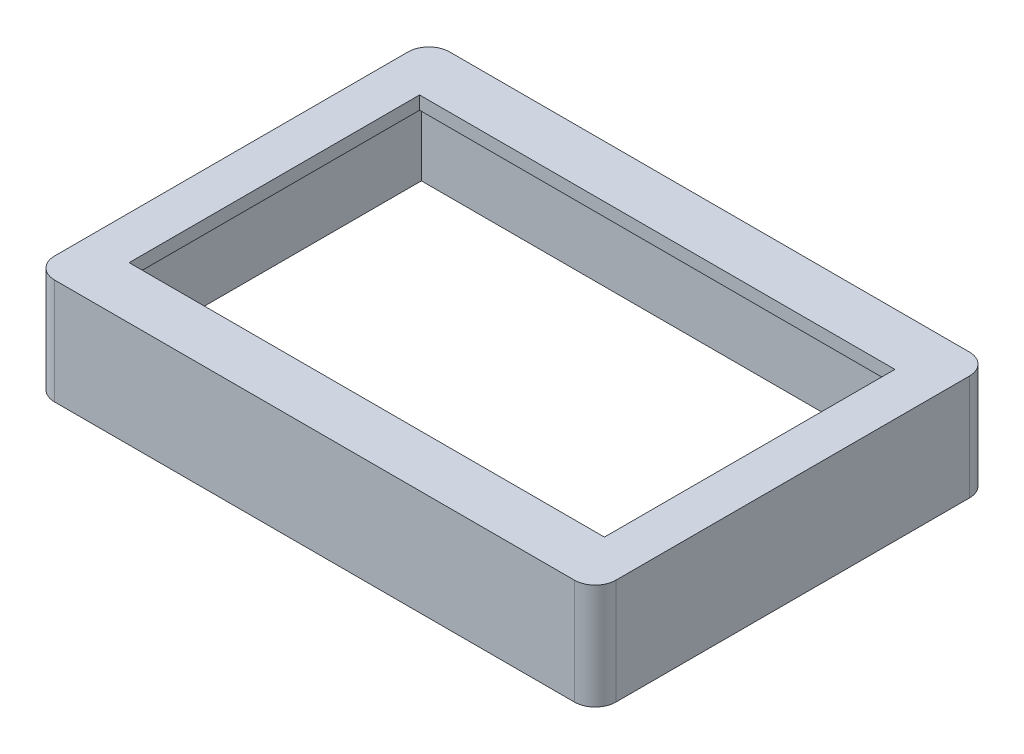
from build123d import *

# Parameters (mm, degrees)
SKETCH1_W           = 135
SKETCH1_H           = 95
BOSS_EXTRUDE1_DEPTH = 25.4
SKETCH2_W           = 114.3
SKETCH2_H           = 69.85
CUT_EXTRUDE1_DEPTH  = 168.018442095
SKETCH4_W           = 128.436224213
SKETCH4_H           = 85.4
CUT_EXTRUDE2_DEPTH  = 22.225
FILLET1_R           = 5


with BuildPart() as part:
    # Sketch1 → Boss-Extrude1 (new body)
    with BuildSketch(Plane(origin=(0, 0, 0), x_dir=(1, 0, 0), z_dir=(0, 1, 0))):
        with Locations((67.5, 47.5)):
            Rectangle(SKETCH1_W, SKETCH1_H)
    extrude(amount=BOSS_EXTRUDE1_DEPTH)

    # Sketch2 → Cut-Extrude1 (cut, through all)
    with BuildSketch(Plane.XZ):
        with Locations((67.5, -47.5)):
            Rectangle(SKETCH2_W, SKETCH2_H)
    extrude(amount=-CUT_EXTRUDE1_DEPTH, mode=Mode.SUBTRACT)

    # Sketch4 → Cut-Extrude2 (cut)
    with BuildSketch(Plane.XZ):
        with Locations((67.281887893, -47.446666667)):
            Rectangle(SKETCH4_W, SKETCH4_H)
    extrude(amount=-CUT_EXTRUDE2_DEPTH, mode=Mode.SUBTRACT)

    # Fillet1
    fillet1_edges = [part.edges().sort_by_distance(p)[0] for p in [
        (0, 12.7, -95),
        (135, 12.7, -95),
        (135, 12.7, 0),
        (0, 12.7, 0),
    ]]
    fillet(fillet1_edges, radius=FILLET1_R)


solid = part.part
